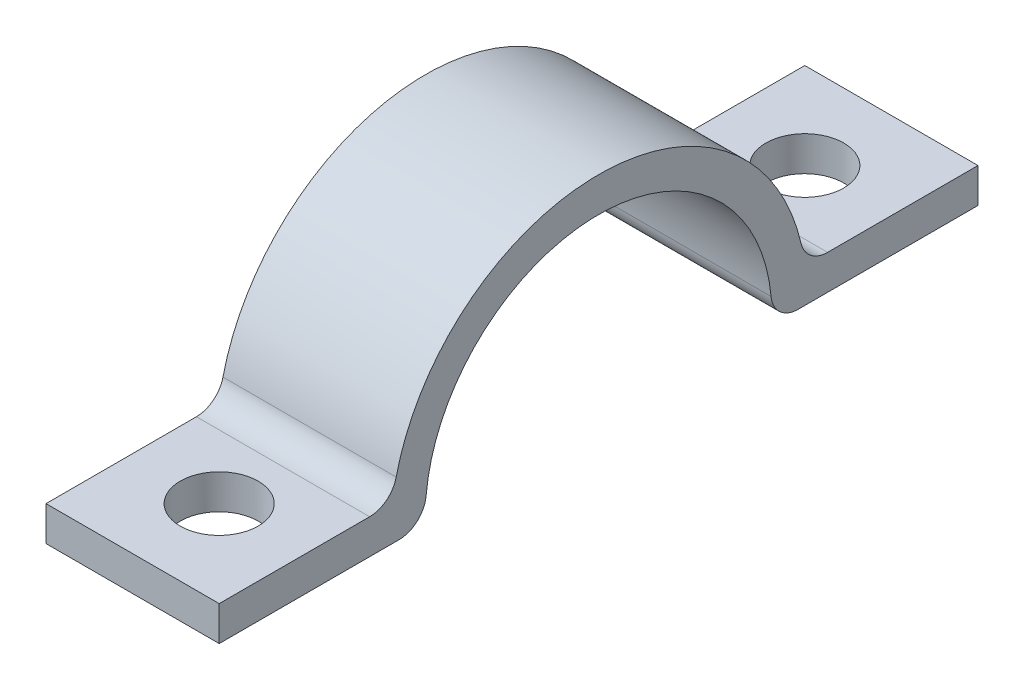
ISO-10303-21;
HEADER;
FILE_DESCRIPTION(('STEP AP214'),'2;1');
FILE_NAME('part.step','',(''),(''),'','','');
FILE_SCHEMA(('AUTOMOTIVE_DESIGN { 1 0 10303 214 1 1 1 1 }'));
ENDSEC;
DATA;
#1=APPLICATION_CONTEXT('core data for automotive mechanical design processes');
#2=APPLICATION_PROTOCOL_DEFINITION('international standard','automotive_design',2000,#1);
#3=PRODUCT_CONTEXT('',#1,'mechanical');
#4=PRODUCT('Part','Part','',(#3));
#5=PRODUCT_RELATED_PRODUCT_CATEGORY('part','',(#4));
#6=PRODUCT_DEFINITION_FORMATION('','',#4);
#7=PRODUCT_DEFINITION_CONTEXT('part definition',#1,'design');
#8=PRODUCT_DEFINITION('design','',#6,#7);
#9=PRODUCT_DEFINITION_SHAPE('','',#8);
#10=(LENGTH_UNIT() NAMED_UNIT(*) SI_UNIT(.MILLI.,.METRE.));
#11=(NAMED_UNIT(*) PLANE_ANGLE_UNIT() SI_UNIT($,.RADIAN.));
#12=(NAMED_UNIT(*) SI_UNIT($,.STERADIAN.) SOLID_ANGLE_UNIT());
#13=UNCERTAINTY_MEASURE_WITH_UNIT(LENGTH_MEASURE(1.E-05),#10,'distance_accuracy_value','');
#14=(GEOMETRIC_REPRESENTATION_CONTEXT(3) GLOBAL_UNCERTAINTY_ASSIGNED_CONTEXT((#13)) GLOBAL_UNIT_ASSIGNED_CONTEXT((#10,
#11,#12)) REPRESENTATION_CONTEXT('',''));
#15=CARTESIAN_POINT('',(0.,0.,0.));
#16=DIRECTION('',(0.,0.,1.));
#17=DIRECTION('',(1.,0.,0.));
#18=AXIS2_PLACEMENT_3D('',#15,#16,#17);
#19=CARTESIAN_POINT('',(31.75,0.,0.));
#20=DIRECTION('',(0.,1.,0.));
#21=DIRECTION('',(0.,0.,1.));
#22=AXIS2_PLACEMENT_3D('',#19,#20,#21);
#23=PLANE('',#22);
#24=CARTESIAN_POINT('',(15.875,0.,-15.875));
#25=DIRECTION('',(0.,1.,0.));
#26=DIRECTION('',(0.,0.,1.));
#27=AXIS2_PLACEMENT_3D('',#24,#25,#26);
#28=CIRCLE('',#27,7.14375);
#29=CARTESIAN_POINT('',(15.875,0.,-8.73125));
#30=VERTEX_POINT('',#29);
#31=EDGE_CURVE('E249',#30,#30,#28,.T.);
#32=ORIENTED_EDGE('',*,*,#31,.T.);
#33=EDGE_LOOP('',(#32));
#34=FACE_BOUND('',#33,.T.);
#35=DIRECTION('',(0.,0.,-1.));
#36=VECTOR('',#35,1.);
#37=CARTESIAN_POINT('',(0.,0.,0.));
#38=LINE('',#37,#36);
#39=CARTESIAN_POINT('',(0.,0.,0.));
#40=VERTEX_POINT('',#39);
#41=CARTESIAN_POINT('',(0.,0.,-32.9599523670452));
#42=VERTEX_POINT('',#41);
#43=EDGE_CURVE('E166',#40,#42,#38,.T.);
#44=ORIENTED_EDGE('',*,*,#43,.T.);
#45=DIRECTION('',(-1.,0.,0.));
#46=VECTOR('',#45,1.);
#47=CARTESIAN_POINT('',(31.75,0.,-32.9599523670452));
#48=LINE('',#47,#46);
#49=CARTESIAN_POINT('',(31.75,0.,-32.9599523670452));
#50=VERTEX_POINT('',#49);
#51=EDGE_CURVE('E211',#42,#50,#48,.F.);
#52=ORIENTED_EDGE('',*,*,#51,.T.);
#53=DIRECTION('',(0.,0.,-1.));
#54=VECTOR('',#53,1.);
#55=CARTESIAN_POINT('',(31.75,0.,0.));
#56=LINE('',#55,#54);
#57=CARTESIAN_POINT('',(31.75,0.,0.));
#58=VERTEX_POINT('',#57);
#59=EDGE_CURVE('E185',#58,#50,#56,.T.);
#60=ORIENTED_EDGE('',*,*,#59,.F.);
#61=DIRECTION('',(-1.,0.,0.));
#62=VECTOR('',#61,1.);
#63=CARTESIAN_POINT('',(31.75,0.,0.));
#64=LINE('',#63,#62);
#65=EDGE_CURVE('E165',#58,#40,#64,.T.);
#66=ORIENTED_EDGE('',*,*,#65,.T.);
#67=EDGE_LOOP('',(#44,#52,#60,#66));
#68=FACE_BOUND('',#67,.T.);
#69=ADVANCED_FACE('F39',(#34,#68),#23,.F.);
#70=CARTESIAN_POINT('',(31.75,1.58750000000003,-69.5511718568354));
#71=DIRECTION('',(-1.,0.,0.));
#72=DIRECTION('',(0.,0.,1.));
#73=AXIS2_PLACEMENT_3D('',#70,#71,#72);
#74=CYLINDRICAL_SURFACE('',#73,31.75);
#75=CARTESIAN_POINT('',(0.,1.58750000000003,-69.5511718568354));
#76=DIRECTION('',(-1.,0.,0.));
#77=DIRECTION('',(0.,0.,1.));
#78=AXIS2_PLACEMENT_3D('',#75,#76,#77);
#79=CIRCLE('',#78,31.75);
#80=CARTESIAN_POINT('',(0.,4.53571428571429,-37.9383495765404));
#81=VERTEX_POINT('',#80);
#82=CARTESIAN_POINT('',(0.,4.5357142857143,-101.16399413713));
#83=VERTEX_POINT('',#82);
#84=EDGE_CURVE('E169',#81,#83,#79,.T.);
#85=ORIENTED_EDGE('',*,*,#84,.T.);
#86=DIRECTION('',(-1.,0.,0.));
#87=VECTOR('',#86,1.);
#88=CARTESIAN_POINT('',(31.75,4.5357142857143,-101.16399413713));
#89=LINE('',#88,#87);
#90=CARTESIAN_POINT('',(31.75,4.5357142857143,-101.16399413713));
#91=VERTEX_POINT('',#90);
#92=EDGE_CURVE('E206',#83,#91,#89,.F.);
#93=ORIENTED_EDGE('',*,*,#92,.T.);
#94=CARTESIAN_POINT('',(31.75,1.58750000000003,-69.5511718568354));
#95=DIRECTION('',(-1.,0.,0.));
#96=DIRECTION('',(0.,0.,1.));
#97=AXIS2_PLACEMENT_3D('',#94,#95,#96);
#98=CIRCLE('',#97,31.75);
#99=CARTESIAN_POINT('',(31.75,4.53571428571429,-37.9383495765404));
#100=VERTEX_POINT('',#99);
#101=EDGE_CURVE('E139',#100,#91,#98,.T.);
#102=ORIENTED_EDGE('',*,*,#101,.F.);
#103=DIRECTION('',(-1.,0.,0.));
#104=VECTOR('',#103,1.);
#105=CARTESIAN_POINT('',(31.75,4.53571428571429,-37.9383495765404));
#106=LINE('',#105,#104);
#107=EDGE_CURVE('E203',#100,#81,#106,.T.);
#108=ORIENTED_EDGE('',*,*,#107,.T.);
#109=EDGE_LOOP('',(#85,#93,#102,#108));
#110=FACE_BOUND('',#109,.T.);
#111=ADVANCED_FACE('F282',(#110),#74,.F.);
#112=CARTESIAN_POINT('',(31.75,0.,-101.301171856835));
#113=DIRECTION('',(0.,1.,0.));
#114=DIRECTION('',(0.,0.,1.));
#115=AXIS2_PLACEMENT_3D('',#112,#113,#114);
#116=PLANE('',#115);
#117=CARTESIAN_POINT('',(15.875,0.,-123.227343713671));
#118=DIRECTION('',(0.,1.,0.));
#119=DIRECTION('',(0.,0.,1.));
#120=AXIS2_PLACEMENT_3D('',#117,#118,#119);
#121=CIRCLE('',#120,7.14375);
#122=CARTESIAN_POINT('',(15.875,0.,-116.083593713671));
#123=VERTEX_POINT('',#122);
#124=EDGE_CURVE('E195',#123,#123,#121,.T.);
#125=ORIENTED_EDGE('',*,*,#124,.T.);
#126=EDGE_LOOP('',(#125));
#127=FACE_BOUND('',#126,.T.);
#128=DIRECTION('',(0.,0.,-1.));
#129=VECTOR('',#128,1.);
#130=CARTESIAN_POINT('',(31.75,0.,-101.301171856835));
#131=LINE('',#130,#129);
#132=CARTESIAN_POINT('',(31.75,0.,-106.142391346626));
#133=VERTEX_POINT('',#132);
#134=CARTESIAN_POINT('',(31.75,0.,-139.102343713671));
#135=VERTEX_POINT('',#134);
#136=EDGE_CURVE('E126',#133,#135,#131,.T.);
#137=ORIENTED_EDGE('',*,*,#136,.F.);
#138=DIRECTION('',(-1.,0.,0.));
#139=VECTOR('',#138,1.);
#140=CARTESIAN_POINT('',(31.75,0.,-106.142391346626));
#141=LINE('',#140,#139);
#142=CARTESIAN_POINT('',(0.,0.,-106.142391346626));
#143=VERTEX_POINT('',#142);
#144=EDGE_CURVE('E148',#133,#143,#141,.T.);
#145=ORIENTED_EDGE('',*,*,#144,.T.);
#146=DIRECTION('',(0.,0.,-1.));
#147=VECTOR('',#146,1.);
#148=CARTESIAN_POINT('',(0.,0.,-101.301171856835));
#149=LINE('',#148,#147);
#150=CARTESIAN_POINT('',(0.,0.,-139.102343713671));
#151=VERTEX_POINT('',#150);
#152=EDGE_CURVE('E145',#143,#151,#149,.T.);
#153=ORIENTED_EDGE('',*,*,#152,.T.);
#154=DIRECTION('',(-1.,0.,0.));
#155=VECTOR('',#154,1.);
#156=CARTESIAN_POINT('',(31.75,0.,-139.102343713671));
#157=LINE('',#156,#155);
#158=EDGE_CURVE('E142',#135,#151,#157,.T.);
#159=ORIENTED_EDGE('',*,*,#158,.F.);
#160=EDGE_LOOP('',(#137,#145,#153,#159));
#161=FACE_BOUND('',#160,.T.);
#162=ADVANCED_FACE('F143',(#127,#161),#116,.F.);
#163=CARTESIAN_POINT('',(31.75,0.,-139.102343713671));
#164=DIRECTION('',(0.,0.,1.));
#165=DIRECTION('',(1.,0.,0.));
#166=AXIS2_PLACEMENT_3D('',#163,#164,#165);
#167=PLANE('',#166);
#168=DIRECTION('',(0.,1.,0.));
#169=VECTOR('',#168,1.);
#170=CARTESIAN_POINT('',(0.,0.,-139.102343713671));
#171=LINE('',#170,#169);
#172=CARTESIAN_POINT('',(0.,6.35000000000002,-139.102343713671));
#173=VERTEX_POINT('',#172);
#174=EDGE_CURVE('E174',#151,#173,#171,.T.);
#175=ORIENTED_EDGE('',*,*,#174,.T.);
#176=DIRECTION('',(-1.,0.,0.));
#177=VECTOR('',#176,1.);
#178=CARTESIAN_POINT('',(31.75,6.35000000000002,-139.102343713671));
#179=LINE('',#178,#177);
#180=CARTESIAN_POINT('',(31.75,6.35000000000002,-139.102343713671));
#181=VERTEX_POINT('',#180);
#182=EDGE_CURVE('E149',#181,#173,#179,.T.);
#183=ORIENTED_EDGE('',*,*,#182,.F.);
#184=DIRECTION('',(0.,1.,0.));
#185=VECTOR('',#184,1.);
#186=CARTESIAN_POINT('',(31.75,0.,-139.102343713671));
#187=LINE('',#186,#185);
#188=EDGE_CURVE('E132',#135,#181,#187,.T.);
#189=ORIENTED_EDGE('',*,*,#188,.F.);
#190=ORIENTED_EDGE('',*,*,#158,.T.);
#191=EDGE_LOOP('',(#175,#183,#189,#190));
#192=FACE_BOUND('',#191,.T.);
#193=ADVANCED_FACE('F151',(#192),#167,.F.);
#194=CARTESIAN_POINT('',(31.75,6.35000000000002,-139.102343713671));
#195=DIRECTION('',(0.,-1.,0.));
#196=DIRECTION('',(0.,0.,-1.));
#197=AXIS2_PLACEMENT_3D('',#194,#195,#196);
#198=PLANE('',#197);
#199=CARTESIAN_POINT('',(15.875,6.35000000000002,-123.227343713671));
#200=DIRECTION('',(0.,-1.,0.));
#201=DIRECTION('',(0.,0.,-1.));
#202=AXIS2_PLACEMENT_3D('',#199,#200,#201);
#203=CIRCLE('',#202,7.14375);
#204=CARTESIAN_POINT('',(15.875,6.35000000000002,-130.371093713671));
#205=VERTEX_POINT('',#204);
#206=EDGE_CURVE('E170',#205,#205,#203,.T.);
#207=ORIENTED_EDGE('',*,*,#206,.T.);
#208=EDGE_LOOP('',(#207));
#209=FACE_BOUND('',#208,.T.);
#210=DIRECTION('',(0.,0.,1.));
#211=VECTOR('',#210,1.);
#212=CARTESIAN_POINT('',(0.,6.35000000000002,-139.102343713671));
#213=LINE('',#212,#211);
#214=CARTESIAN_POINT('',(0.,6.35000000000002,-111.530971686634));
#215=VERTEX_POINT('',#214);
#216=EDGE_CURVE('E176',#173,#215,#213,.T.);
#217=ORIENTED_EDGE('',*,*,#216,.T.);
#218=DIRECTION('',(1.,0.,0.));
#219=VECTOR('',#218,1.);
#220=CARTESIAN_POINT('',(31.75,6.35000000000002,-111.530971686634));
#221=LINE('',#220,#219);
#222=CARTESIAN_POINT('',(31.75,6.35000000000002,-111.530971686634));
#223=VERTEX_POINT('',#222);
#224=EDGE_CURVE('E217',#215,#223,#221,.T.);
#225=ORIENTED_EDGE('',*,*,#224,.T.);
#226=DIRECTION('',(0.,0.,1.));
#227=VECTOR('',#226,1.);
#228=CARTESIAN_POINT('',(31.75,6.35000000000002,-139.102343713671));
#229=LINE('',#228,#227);
#230=EDGE_CURVE('E154',#181,#223,#229,.T.);
#231=ORIENTED_EDGE('',*,*,#230,.F.);
#232=ORIENTED_EDGE('',*,*,#182,.T.);
#233=EDGE_LOOP('',(#217,#225,#231,#232));
#234=FACE_BOUND('',#233,.T.);
#235=ADVANCED_FACE('F264',(#209,#234),#198,.F.);
#236=CARTESIAN_POINT('',(31.75,1.5875,-69.5511718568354));
#237=DIRECTION('',(-1.,0.,0.));
#238=DIRECTION('',(0.,0.,1.));
#239=AXIS2_PLACEMENT_3D('',#236,#237,#238);
#240=CYLINDRICAL_SURFACE('',#239,38.1);
#241=CARTESIAN_POINT('',(31.75,1.5875,-69.5511718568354));
#242=DIRECTION('',(1.,0.,0.));
#243=DIRECTION('',(0.,0.,1.));
#244=AXIS2_PLACEMENT_3D('',#241,#242,#243);
#245=CIRCLE('',#244,38.1);
#246=CARTESIAN_POINT('',(31.75,10.2174593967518,-106.660925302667));
#247=VERTEX_POINT('',#246);
#248=CARTESIAN_POINT('',(31.75,10.2174593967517,-32.4414184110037));
#249=VERTEX_POINT('',#248);
#250=EDGE_CURVE('E156',#247,#249,#245,.T.);
#251=ORIENTED_EDGE('',*,*,#250,.F.);
#252=DIRECTION('',(-1.,0.,0.));
#253=VECTOR('',#252,1.);
#254=CARTESIAN_POINT('',(31.75,10.2174593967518,-106.660925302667));
#255=LINE('',#254,#253);
#256=CARTESIAN_POINT('',(0.,10.2174593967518,-106.660925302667));
#257=VERTEX_POINT('',#256);
#258=EDGE_CURVE('E214',#247,#257,#255,.T.);
#259=ORIENTED_EDGE('',*,*,#258,.T.);
#260=CARTESIAN_POINT('',(0.,1.5875,-69.5511718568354));
#261=DIRECTION('',(1.,0.,0.));
#262=DIRECTION('',(0.,0.,1.));
#263=AXIS2_PLACEMENT_3D('',#260,#261,#262);
#264=CIRCLE('',#263,38.1);
#265=CARTESIAN_POINT('',(0.,10.2174593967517,-32.4414184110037));
#266=VERTEX_POINT('',#265);
#267=EDGE_CURVE('E179',#257,#266,#264,.T.);
#268=ORIENTED_EDGE('',*,*,#267,.T.);
#269=DIRECTION('',(-1.,0.,0.));
#270=VECTOR('',#269,1.);
#271=CARTESIAN_POINT('',(31.75,10.2174593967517,-32.4414184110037));
#272=LINE('',#271,#270);
#273=EDGE_CURVE('E60',#266,#249,#272,.F.);
#274=ORIENTED_EDGE('',*,*,#273,.T.);
#275=EDGE_LOOP('',(#251,#259,#268,#274));
#276=FACE_BOUND('',#275,.T.);
#277=ADVANCED_FACE('F232',(#276),#240,.T.);
#278=CARTESIAN_POINT('',(31.75,6.35,0.));
#279=DIRECTION('',(0.,-1.,0.));
#280=DIRECTION('',(0.,0.,-1.));
#281=AXIS2_PLACEMENT_3D('',#278,#279,#280);
#282=PLANE('',#281);
#283=CARTESIAN_POINT('',(15.875,6.35,-15.875));
#284=DIRECTION('',(0.,-1.,0.));
#285=DIRECTION('',(0.,0.,-1.));
#286=AXIS2_PLACEMENT_3D('',#283,#284,#285);
#287=CIRCLE('',#286,7.14375);
#288=CARTESIAN_POINT('',(15.875,6.35,-23.01875));
#289=VERTEX_POINT('',#288);
#290=EDGE_CURVE('E192',#289,#289,#287,.T.);
#291=ORIENTED_EDGE('',*,*,#290,.T.);
#292=EDGE_LOOP('',(#291));
#293=FACE_BOUND('',#292,.T.);
#294=DIRECTION('',(0.,0.,1.));
#295=VECTOR('',#294,1.);
#296=CARTESIAN_POINT('',(31.75,6.35,0.));
#297=LINE('',#296,#295);
#298=CARTESIAN_POINT('',(31.75,6.35,-27.5713720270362));
#299=VERTEX_POINT('',#298);
#300=CARTESIAN_POINT('',(31.75,6.35,0.));
#301=VERTEX_POINT('',#300);
#302=EDGE_CURVE('E161',#299,#301,#297,.T.);
#303=ORIENTED_EDGE('',*,*,#302,.F.);
#304=DIRECTION('',(1.,0.,0.));
#305=VECTOR('',#304,1.);
#306=CARTESIAN_POINT('',(0.,6.35,-27.5713720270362));
#307=LINE('',#306,#305);
#308=CARTESIAN_POINT('',(0.,6.35,-27.5713720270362));
#309=VERTEX_POINT('',#308);
#310=EDGE_CURVE('E219',#299,#309,#307,.F.);
#311=ORIENTED_EDGE('',*,*,#310,.T.);
#312=DIRECTION('',(0.,0.,1.));
#313=VECTOR('',#312,1.);
#314=CARTESIAN_POINT('',(0.,6.35,0.));
#315=LINE('',#314,#313);
#316=CARTESIAN_POINT('',(0.,6.35,0.));
#317=VERTEX_POINT('',#316);
#318=EDGE_CURVE('E181',#309,#317,#315,.T.);
#319=ORIENTED_EDGE('',*,*,#318,.T.);
#320=DIRECTION('',(-1.,0.,0.));
#321=VECTOR('',#320,1.);
#322=CARTESIAN_POINT('',(31.75,6.35,0.));
#323=LINE('',#322,#321);
#324=EDGE_CURVE('E188',#301,#317,#323,.T.);
#325=ORIENTED_EDGE('',*,*,#324,.F.);
#326=EDGE_LOOP('',(#303,#311,#319,#325));
#327=FACE_BOUND('',#326,.T.);
#328=ADVANCED_FACE('F235',(#293,#327),#282,.F.);
#329=CARTESIAN_POINT('',(31.75,0.,0.));
#330=DIRECTION('',(0.,0.,-1.));
#331=DIRECTION('',(-1.,0.,0.));
#332=AXIS2_PLACEMENT_3D('',#329,#330,#331);
#333=PLANE('',#332);
#334=DIRECTION('',(0.,-1.,0.));
#335=VECTOR('',#334,1.);
#336=CARTESIAN_POINT('',(0.,0.,0.));
#337=LINE('',#336,#335);
#338=EDGE_CURVE('E183',#317,#40,#337,.T.);
#339=ORIENTED_EDGE('',*,*,#338,.T.);
#340=ORIENTED_EDGE('',*,*,#65,.F.);
#341=DIRECTION('',(0.,-1.,0.));
#342=VECTOR('',#341,1.);
#343=CARTESIAN_POINT('',(31.75,0.,0.));
#344=LINE('',#343,#342);
#345=EDGE_CURVE('E163',#301,#58,#344,.T.);
#346=ORIENTED_EDGE('',*,*,#345,.F.);
#347=ORIENTED_EDGE('',*,*,#324,.T.);
#348=EDGE_LOOP('',(#339,#340,#346,#347));
#349=FACE_BOUND('',#348,.T.);
#350=ADVANCED_FACE('F243',(#349),#333,.F.);
#351=CARTESIAN_POINT('',(31.75,1.58750000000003,-69.5511718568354));
#352=DIRECTION('',(-1.,0.,0.));
#353=DIRECTION('',(0.,0.,1.));
#354=AXIS2_PLACEMENT_3D('',#351,#352,#353);
#355=PLANE('',#354);
#356=ORIENTED_EDGE('',*,*,#101,.T.);
#357=CARTESIAN_POINT('',(31.75,5.00000000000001,-106.142391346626));
#358=DIRECTION('',(-1.,0.,0.));
#359=DIRECTION('',(0.,0.,1.));
#360=AXIS2_PLACEMENT_3D('',#357,#358,#359);
#361=CIRCLE('',#360,5.);
#362=EDGE_CURVE('E135',#91,#133,#361,.F.);
#363=ORIENTED_EDGE('',*,*,#362,.T.);
#364=ORIENTED_EDGE('',*,*,#136,.T.);
#365=ORIENTED_EDGE('',*,*,#188,.T.);
#366=ORIENTED_EDGE('',*,*,#230,.T.);
#367=CARTESIAN_POINT('',(31.75,11.35,-111.530971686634));
#368=DIRECTION('',(-1.,0.,0.));
#369=DIRECTION('',(0.,0.,1.));
#370=AXIS2_PLACEMENT_3D('',#367,#368,#369);
#371=CIRCLE('',#370,5.);
#372=EDGE_CURVE('E224',#223,#247,#371,.T.);
#373=ORIENTED_EDGE('',*,*,#372,.T.);
#374=ORIENTED_EDGE('',*,*,#250,.T.);
#375=CARTESIAN_POINT('',(31.75,11.35,-27.5713720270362));
#376=DIRECTION('',(-1.,0.,0.));
#377=DIRECTION('',(0.,0.,1.));
#378=AXIS2_PLACEMENT_3D('',#375,#376,#377);
#379=CIRCLE('',#378,5.);
#380=EDGE_CURVE('E11',#249,#299,#379,.T.);
#381=ORIENTED_EDGE('',*,*,#380,.T.);
#382=ORIENTED_EDGE('',*,*,#302,.T.);
#383=ORIENTED_EDGE('',*,*,#345,.T.);
#384=ORIENTED_EDGE('',*,*,#59,.T.);
#385=CARTESIAN_POINT('',(31.75,5.,-32.9599523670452));
#386=DIRECTION('',(-1.,0.,0.));
#387=DIRECTION('',(0.,0.,1.));
#388=AXIS2_PLACEMENT_3D('',#385,#386,#387);
#389=CIRCLE('',#388,5.);
#390=EDGE_CURVE('E208',#50,#100,#389,.F.);
#391=ORIENTED_EDGE('',*,*,#390,.T.);
#392=EDGE_LOOP('',(#356,#363,#364,#365,#366,#373,#374,#381,#382,#383,#384,#391));
#393=FACE_BOUND('',#392,.T.);
#394=ADVANCED_FACE('F129',(#393),#355,.F.);
#395=CARTESIAN_POINT('',(0.,1.58750000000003,-69.5511718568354));
#396=DIRECTION('',(-1.,0.,0.));
#397=DIRECTION('',(0.,0.,1.));
#398=AXIS2_PLACEMENT_3D('',#395,#396,#397);
#399=PLANE('',#398);
#400=ORIENTED_EDGE('',*,*,#152,.F.);
#401=CARTESIAN_POINT('',(0.,5.00000000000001,-106.142391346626));
#402=DIRECTION('',(-1.,0.,0.));
#403=DIRECTION('',(0.,0.,1.));
#404=AXIS2_PLACEMENT_3D('',#401,#402,#403);
#405=CIRCLE('',#404,5.);
#406=EDGE_CURVE('E201',#143,#83,#405,.T.);
#407=ORIENTED_EDGE('',*,*,#406,.T.);
#408=ORIENTED_EDGE('',*,*,#84,.F.);
#409=CARTESIAN_POINT('',(0.,5.,-32.9599523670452));
#410=DIRECTION('',(-1.,0.,0.));
#411=DIRECTION('',(0.,0.,1.));
#412=AXIS2_PLACEMENT_3D('',#409,#410,#411);
#413=CIRCLE('',#412,5.);
#414=EDGE_CURVE('E199',#81,#42,#413,.T.);
#415=ORIENTED_EDGE('',*,*,#414,.T.);
#416=ORIENTED_EDGE('',*,*,#43,.F.);
#417=ORIENTED_EDGE('',*,*,#338,.F.);
#418=ORIENTED_EDGE('',*,*,#318,.F.);
#419=CARTESIAN_POINT('',(0.,11.35,-27.5713720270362));
#420=DIRECTION('',(-1.,0.,0.));
#421=DIRECTION('',(0.,0.,1.));
#422=AXIS2_PLACEMENT_3D('',#419,#420,#421);
#423=CIRCLE('',#422,5.);
#424=EDGE_CURVE('E47',#309,#266,#423,.F.);
#425=ORIENTED_EDGE('',*,*,#424,.T.);
#426=ORIENTED_EDGE('',*,*,#267,.F.);
#427=CARTESIAN_POINT('',(0.,11.35,-111.530971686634));
#428=DIRECTION('',(-1.,0.,0.));
#429=DIRECTION('',(0.,0.,1.));
#430=AXIS2_PLACEMENT_3D('',#427,#428,#429);
#431=CIRCLE('',#430,5.);
#432=EDGE_CURVE('E222',#257,#215,#431,.F.);
#433=ORIENTED_EDGE('',*,*,#432,.T.);
#434=ORIENTED_EDGE('',*,*,#216,.F.);
#435=ORIENTED_EDGE('',*,*,#174,.F.);
#436=EDGE_LOOP('',(#400,#407,#408,#415,#416,#417,#418,#425,#426,#433,#434,#435));
#437=FACE_BOUND('',#436,.T.);
#438=ADVANCED_FACE('F228',(#437),#399,.T.);
#439=CARTESIAN_POINT('',(15.875,0.,-15.875));
#440=DIRECTION('',(0.,1.,0.));
#441=DIRECTION('',(0.,0.,1.));
#442=AXIS2_PLACEMENT_3D('',#439,#440,#441);
#443=CYLINDRICAL_SURFACE('',#442,7.14375);
#444=ORIENTED_EDGE('',*,*,#31,.F.);
#445=EDGE_LOOP('',(#444));
#446=FACE_BOUND('',#445,.T.);
#447=ORIENTED_EDGE('',*,*,#290,.F.);
#448=EDGE_LOOP('',(#447));
#449=FACE_BOUND('',#448,.T.);
#450=ADVANCED_FACE('F260',(#446,#449),#443,.F.);
#451=CARTESIAN_POINT('',(15.875,0.,-123.227343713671));
#452=DIRECTION('',(0.,1.,0.));
#453=DIRECTION('',(0.,0.,1.));
#454=AXIS2_PLACEMENT_3D('',#451,#452,#453);
#455=CYLINDRICAL_SURFACE('',#454,7.14375);
#456=ORIENTED_EDGE('',*,*,#124,.F.);
#457=EDGE_LOOP('',(#456));
#458=FACE_BOUND('',#457,.T.);
#459=ORIENTED_EDGE('',*,*,#206,.F.);
#460=EDGE_LOOP('',(#459));
#461=FACE_BOUND('',#460,.T.);
#462=ADVANCED_FACE('F256',(#458,#461),#455,.F.);
#463=CARTESIAN_POINT('',(31.75,5.00000000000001,-106.142391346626));
#464=DIRECTION('',(-1.,0.,0.));
#465=DIRECTION('',(0.,0.,1.));
#466=AXIS2_PLACEMENT_3D('',#463,#464,#465);
#467=CYLINDRICAL_SURFACE('',#466,5.);
#468=ORIENTED_EDGE('',*,*,#362,.F.);
#469=ORIENTED_EDGE('',*,*,#92,.F.);
#470=ORIENTED_EDGE('',*,*,#406,.F.);
#471=ORIENTED_EDGE('',*,*,#144,.F.);
#472=EDGE_LOOP('',(#468,#469,#470,#471));
#473=FACE_BOUND('',#472,.T.);
#474=ADVANCED_FACE('F259',(#473),#467,.T.);
#475=CARTESIAN_POINT('',(31.75,5.,-32.9599523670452));
#476=DIRECTION('',(-1.,0.,0.));
#477=DIRECTION('',(0.,0.,1.));
#478=AXIS2_PLACEMENT_3D('',#475,#476,#477);
#479=CYLINDRICAL_SURFACE('',#478,5.);
#480=ORIENTED_EDGE('',*,*,#390,.F.);
#481=ORIENTED_EDGE('',*,*,#51,.F.);
#482=ORIENTED_EDGE('',*,*,#414,.F.);
#483=ORIENTED_EDGE('',*,*,#107,.F.);
#484=EDGE_LOOP('',(#480,#481,#482,#483));
#485=FACE_BOUND('',#484,.T.);
#486=ADVANCED_FACE('F274',(#485),#479,.T.);
#487=CARTESIAN_POINT('',(31.75,11.35,-111.530971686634));
#488=DIRECTION('',(-1.,0.,0.));
#489=DIRECTION('',(0.,0.,1.));
#490=AXIS2_PLACEMENT_3D('',#487,#488,#489);
#491=CYLINDRICAL_SURFACE('',#490,5.);
#492=ORIENTED_EDGE('',*,*,#372,.F.);
#493=ORIENTED_EDGE('',*,*,#224,.F.);
#494=ORIENTED_EDGE('',*,*,#432,.F.);
#495=ORIENTED_EDGE('',*,*,#258,.F.);
#496=EDGE_LOOP('',(#492,#493,#494,#495));
#497=FACE_BOUND('',#496,.T.);
#498=ADVANCED_FACE('F272',(#497),#491,.F.);
#499=CARTESIAN_POINT('',(31.75,11.35,-27.5713720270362));
#500=DIRECTION('',(-1.,0.,0.));
#501=DIRECTION('',(0.,0.,1.));
#502=AXIS2_PLACEMENT_3D('',#499,#500,#501);
#503=CYLINDRICAL_SURFACE('',#502,5.);
#504=ORIENTED_EDGE('',*,*,#380,.F.);
#505=ORIENTED_EDGE('',*,*,#273,.F.);
#506=ORIENTED_EDGE('',*,*,#424,.F.);
#507=ORIENTED_EDGE('',*,*,#310,.F.);
#508=EDGE_LOOP('',(#504,#505,#506,#507));
#509=FACE_BOUND('',#508,.T.);
#510=ADVANCED_FACE('F41',(#509),#503,.F.);
#511=CLOSED_SHELL('',(#69,#111,#162,#193,#235,#277,#328,#350,#394,#438,#450,#462,#474,#486,#498,#510));
#512=MANIFOLD_SOLID_BREP('B2',#511);
#513=ADVANCED_BREP_SHAPE_REPRESENTATION('',(#18,#512),#14);
#514=SHAPE_DEFINITION_REPRESENTATION(#9,#513);
ENDSEC;
END-ISO-10303-21;
